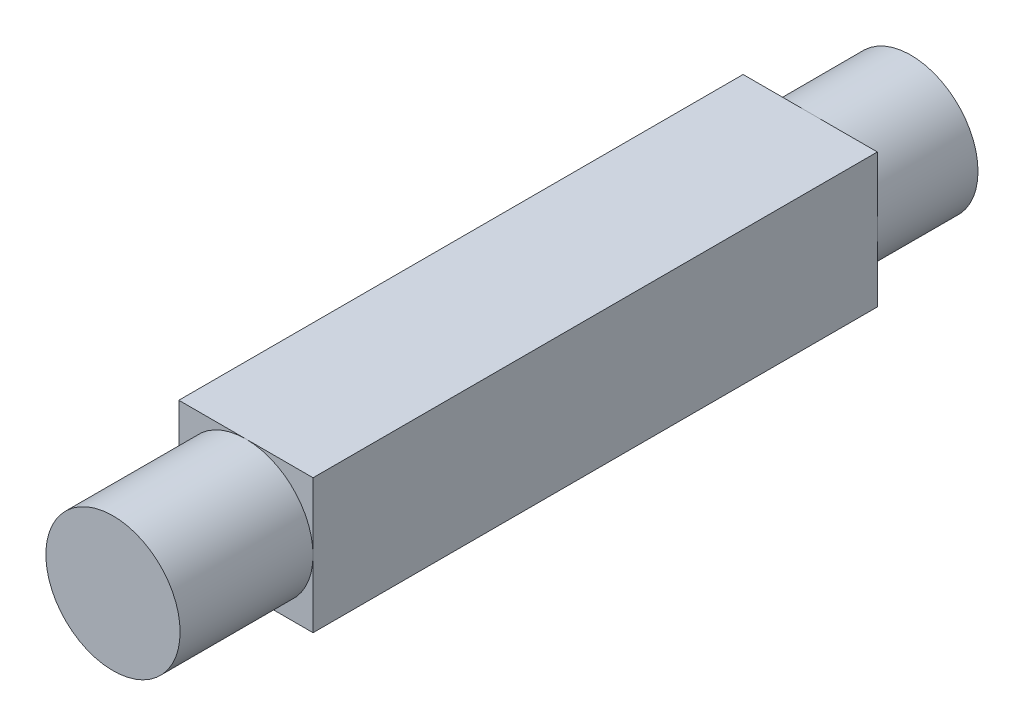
from build123d import *

# Parameters (mm, degrees)
SKETCH1_W           = 9.525
SKETCH1_H           = 9.525
BOSS_EXTRUDE1_DEPTH = 84.5566
SKETCH2_OUTSIDE_W   = 28.649
SKETCH2_OUTSIDE_H   = 28.649
SKETCH2_OUTSIDE_R   = 4.7625
CUT_EXTRUDE2_DEPTH  = 74.711808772
SKETCH4_OUTSIDE_W   = 28.65
SKETCH4_OUTSIDE_H   = 28.65
SKETCH4_OUTSIDE_R   = 4.7625
CUT_EXTRUDE5_DEPTH  = 7.14248
CUT_EXTRUDE6_START  = -37.373814
SKETCH5_W           = 10.190924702
SKETCH5_H           = 13.390661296
SKETCH5_R           = 4.7625
CUT_EXTRUDE6_DEPTH  = 37.373814
CUT_EXTRUDE7_START  = -27.94
SKETCH6_R           = 4.7625
CUT_EXTRUDE7_DEPTH  = 27.94


with BuildPart() as part:
    # Sketch1 → Boss-Extrude1 (new body)
    with BuildSketch(Plane.XY):
        Rectangle(SKETCH1_W, SKETCH1_H)
    extrude(amount=BOSS_EXTRUDE1_DEPTH)

    # Sketch2 outside → Cut-Extrude2 (cut, through all)
    with BuildSketch(Plane.XY.offset(73.40346)):
        with Locations((0.0005, 0.0005)):
            Rectangle(SKETCH2_OUTSIDE_W, SKETCH2_OUTSIDE_H)
        Circle(SKETCH2_OUTSIDE_R, mode=Mode.SUBTRACT)
    extrude(amount=CUT_EXTRUDE2_DEPTH, mode=Mode.SUBTRACT)

    # Sketch4 outside → Cut-Extrude5 (cut)
    with BuildSketch(Plane(origin=(0, 0, 0), x_dir=(-1, 0, 0), z_dir=(0, 0, -1))):
        Rectangle(SKETCH4_OUTSIDE_W, SKETCH4_OUTSIDE_H)
        with Locations(Location((0, 0, 0), (0, 0, 180))):
            Circle(SKETCH4_OUTSIDE_R, mode=Mode.SUBTRACT)
    extrude(amount=-CUT_EXTRUDE5_DEPTH, mode=Mode.SUBTRACT)

    # Sketch5 → Cut-Extrude6 (cut)
    with BuildSketch(Plane.XY.offset(84.5566).offset(CUT_EXTRUDE6_START)):
        Rectangle(SKETCH5_W, SKETCH5_H)
        Circle(SKETCH5_R, mode=Mode.SUBTRACT)
    extrude(amount=CUT_EXTRUDE6_DEPTH, mode=Mode.SUBTRACT)

    # Sketch6 → Cut-Extrude7 (cut)
    with BuildSketch(Plane.XY.offset(84.5566).offset(CUT_EXTRUDE7_START)):
        Circle(SKETCH6_R)
    extrude(amount=CUT_EXTRUDE7_DEPTH, mode=Mode.SUBTRACT)


solid = part.part
